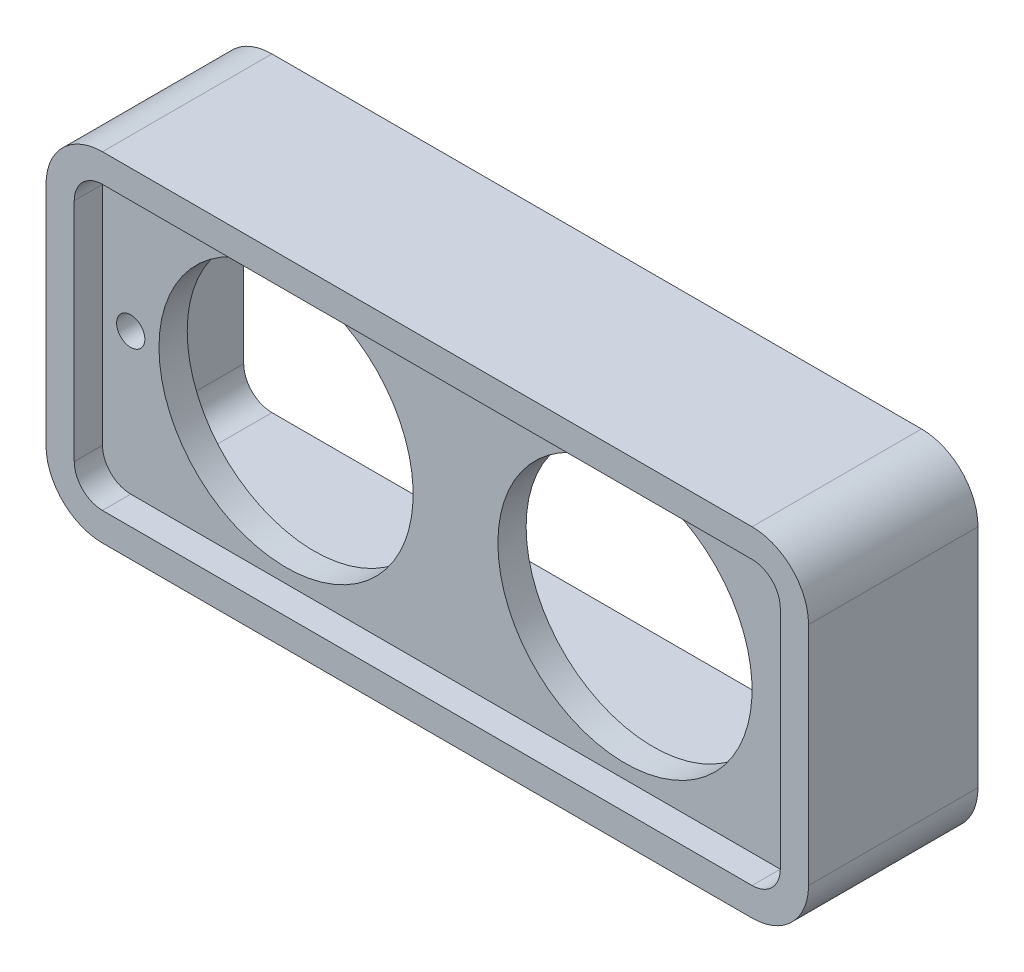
from build123d import *

# Parameters (mm, degrees)
ESQUISSE4_R             = 0.5
BOSS_EXTRU_3_DEPTH      = 6
ENL_V_MAT_EXTRU_4_DEPTH = 4
ESQUISSE9_R             = 4.5
ENL_V_MAT_EXTRU_5_DEPTH = 16.305227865
ENL_V_START             = -1
ENL_V_MAT_EXTRU_6_DEPTH = 1


with BuildPart() as part:
    # Esquisse4 → Boss.-Extru.3 (new body)
    with BuildSketch(Plane.XY):
        with BuildLine():
            Line((-11.5, -6), (11.5, -6))
            ThreePointArc((11.5, -6), (12.914213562, -5.414213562), (13.5, -4))
            Line((13.5, -4), (13.5, 4))
            ThreePointArc((13.5, 4), (12.914213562, 5.414213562), (11.5, 6))
            Line((11.5, 6), (-11.5, 6))
            ThreePointArc((-11.5, 6), (-12.914213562, 5.414213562), (-13.5, 4))
            Line((-13.5, 4), (-13.5, -4))
            ThreePointArc((-13.5, -4), (-12.914213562, -5.414213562), (-11.5, -6))
        make_face()
        with Locations((-11.5, 0)):
            Circle(ESQUISSE4_R, mode=Mode.SUBTRACT)
    extrude(amount=-BOSS_EXTRU_3_DEPTH)

    # Esquisse8 → Enl_v. mat.-Extru.4 (cut)
    with BuildSketch(Plane(origin=(0, 0, -6), x_dir=(-1, 0, 0), z_dir=(0, 0, -1))):
        with BuildLine():
            Line((-11.5, -5), (11.5, -5))
            ThreePointArc((11.5, -5), (12.207106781, -4.707106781), (12.5, -4))
            Line((12.5, -4), (12.5, 4))
            ThreePointArc((12.5, 4), (12.207106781, 4.707106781), (11.5, 5))
            Line((11.5, 5), (-11.5, 5))
            ThreePointArc((-11.5, 5), (-12.207106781, 4.707106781), (-12.5, 4))
            Line((-12.5, 4), (-12.5, -4))
            ThreePointArc((-12.5, -4), (-12.207106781, -4.707106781), (-11.5, -5))
        make_face()
    extrude(amount=-ENL_V_MAT_EXTRU_4_DEPTH, mode=Mode.SUBTRACT)

    # Esquisse9 → Enl_v. mat.-Extru.5 (cut, through all)
    with BuildSketch(Plane(origin=(0, 0, -2), x_dir=(-1, 0, 0), z_dir=(0, 0, -1))):
        with Locations((6, 0)):
            Circle(ESQUISSE9_R)
        with Locations((-6, 0)):
            Circle(ESQUISSE9_R)
    extrude(amount=-ENL_V_MAT_EXTRU_5_DEPTH, mode=Mode.SUBTRACT)

    # Esquisse10 → Enl_v. mat.-Extru.6 (cut)
    with BuildSketch(Plane.XY.offset(ENL_V_START)):
        with BuildLine():
            Line((-11.5, -5), (11.5, -5))
            ThreePointArc((11.5, -5), (12.207106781, -4.707106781), (12.5, -4))
            Line((12.5, -4), (12.5, 4))
            ThreePointArc((12.5, 4), (12.207106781, 4.707106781), (11.5, 5))
            Line((11.5, 5), (-11.5, 5))
            ThreePointArc((-11.5, 5), (-12.207106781, 4.707106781), (-12.5, 4))
            Line((-12.5, 4), (-12.5, -4))
            ThreePointArc((-12.5, -4), (-12.207106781, -4.707106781), (-11.5, -5))
        make_face()
    extrude(amount=ENL_V_MAT_EXTRU_6_DEPTH, mode=Mode.SUBTRACT)


solid = part.part
